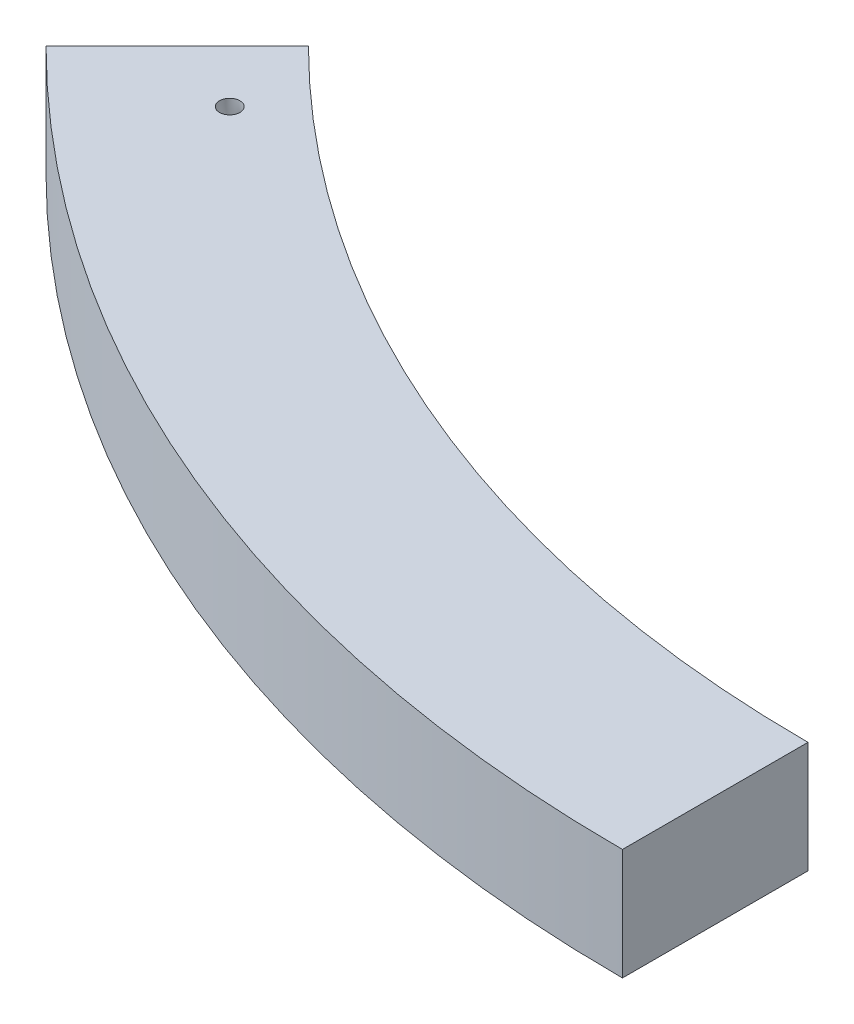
ISO-10303-21;
HEADER;
FILE_DESCRIPTION(('STEP AP214'),'2;1');
FILE_NAME('part.step','',(''),(''),'','','');
FILE_SCHEMA(('AUTOMOTIVE_DESIGN { 1 0 10303 214 1 1 1 1 }'));
ENDSEC;
DATA;
#1=APPLICATION_CONTEXT('core data for automotive mechanical design processes');
#2=APPLICATION_PROTOCOL_DEFINITION('international standard','automotive_design',2000,#1);
#3=PRODUCT_CONTEXT('',#1,'mechanical');
#4=PRODUCT('Part','Part','',(#3));
#5=PRODUCT_RELATED_PRODUCT_CATEGORY('part','',(#4));
#6=PRODUCT_DEFINITION_FORMATION('','',#4);
#7=PRODUCT_DEFINITION_CONTEXT('part definition',#1,'design');
#8=PRODUCT_DEFINITION('design','',#6,#7);
#9=PRODUCT_DEFINITION_SHAPE('','',#8);
#10=(LENGTH_UNIT() NAMED_UNIT(*) SI_UNIT(.MILLI.,.METRE.));
#11=(NAMED_UNIT(*) PLANE_ANGLE_UNIT() SI_UNIT($,.RADIAN.));
#12=(NAMED_UNIT(*) SI_UNIT($,.STERADIAN.) SOLID_ANGLE_UNIT());
#13=UNCERTAINTY_MEASURE_WITH_UNIT(LENGTH_MEASURE(1.E-05),#10,'distance_accuracy_value','');
#14=(GEOMETRIC_REPRESENTATION_CONTEXT(3) GLOBAL_UNCERTAINTY_ASSIGNED_CONTEXT((#13)) GLOBAL_UNIT_ASSIGNED_CONTEXT((#10,
#11,#12)) REPRESENTATION_CONTEXT('',''));
#15=CARTESIAN_POINT('',(0.,0.,0.));
#16=DIRECTION('',(0.,0.,1.));
#17=DIRECTION('',(1.,0.,0.));
#18=AXIS2_PLACEMENT_3D('',#15,#16,#17);
#19=CARTESIAN_POINT('',(0.,300.,0.));
#20=DIRECTION('',(0.,-1.,0.));
#21=DIRECTION('',(0.,0.,-1.));
#22=AXIS2_PLACEMENT_3D('',#19,#20,#21);
#23=CYLINDRICAL_SURFACE('',#22,3250.);
#24=CARTESIAN_POINT('',(-2170.99569715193,138.543366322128,2418.52799797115));
#25=CARTESIAN_POINT('',(-2171.23673635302,139.243817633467,2418.31162878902));
#26=CARTESIAN_POINT('',(-2171.45571442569,139.95785837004,2418.11499897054));
#27=CARTESIAN_POINT('',(-2171.84817019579,141.408426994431,2417.76251869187));
#28=CARTESIAN_POINT('',(-2172.02163584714,142.144960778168,2417.60667902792));
#29=CARTESIAN_POINT('',(-2172.32193749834,143.635870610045,2417.336848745));
#30=CARTESIAN_POINT('',(-2172.44872146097,144.390265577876,2417.22290482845));
#31=CARTESIAN_POINT('',(-2172.65451857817,145.910692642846,2417.03793147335));
#32=CARTESIAN_POINT('',(-2172.73353491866,146.676723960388,2416.96689917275));
#33=CARTESIAN_POINT('',(-2172.84324776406,148.214622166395,2416.86826824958));
#34=CARTESIAN_POINT('',(-2172.87396884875,148.986485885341,2416.84064753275));
#35=CARTESIAN_POINT('',(-2172.88697573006,150.530962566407,2416.82895356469));
#36=CARTESIAN_POINT('',(-2172.86926076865,151.303575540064,2416.84488099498));
#37=CARTESIAN_POINT('',(-2172.7855503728,152.843858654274,2416.9201383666));
#38=CARTESIAN_POINT('',(-2172.7195672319,153.611530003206,2416.97945725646));
#39=CARTESIAN_POINT('',(-2172.53981727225,155.136689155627,2417.1410295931));
#40=CARTESIAN_POINT('',(-2172.42605059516,155.894176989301,2417.24328291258));
#41=CARTESIAN_POINT('',(-2172.1513820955,157.394522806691,2417.49010491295));
#42=CARTESIAN_POINT('',(-2171.99042349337,158.137362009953,2417.63472456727));
#43=CARTESIAN_POINT('',(-2171.62256766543,159.602212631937,2417.96515373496));
#44=CARTESIAN_POINT('',(-2171.41567037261,160.324224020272,2418.15096330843));
#45=CARTESIAN_POINT('',(-2170.95738878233,161.742354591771,2418.5624058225));
#46=CARTESIAN_POINT('',(-2170.70600241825,162.438472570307,2418.78804061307));
#47=CARTESIAN_POINT('',(-2170.16051829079,163.799877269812,2419.27746632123));
#48=CARTESIAN_POINT('',(-2169.8664204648,164.465163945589,2419.54125729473));
#49=CARTESIAN_POINT('',(-2169.23685996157,165.76170285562,2420.10570522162));
#50=CARTESIAN_POINT('',(-2168.90130469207,166.392874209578,2420.40644468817));
#51=CARTESIAN_POINT('',(-2168.19171744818,167.615097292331,2421.0421109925));
#52=CARTESIAN_POINT('',(-2167.81768541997,168.206148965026,2421.37703787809));
#53=CARTESIAN_POINT('',(-2167.03376292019,169.343978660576,2422.0786417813));
#54=CARTESIAN_POINT('',(-2166.62387210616,169.890756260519,2422.44531910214));
#55=CARTESIAN_POINT('',(-2165.77110309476,170.936189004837,2423.20776163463));
#56=CARTESIAN_POINT('',(-2165.32822484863,171.434844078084,2423.60352688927));
#57=CARTESIAN_POINT('',(-2164.41146915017,172.381671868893,2424.42227566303));
#58=CARTESIAN_POINT('',(-2163.93751941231,172.829719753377,2424.8453226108));
#59=CARTESIAN_POINT('',(-2162.96290795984,173.670777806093,2425.71471635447));
#60=CARTESIAN_POINT('',(-2162.46224619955,174.063787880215,2426.1610631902));
#61=CARTESIAN_POINT('',(-2161.43771940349,174.79199476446,2427.07384637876));
#62=CARTESIAN_POINT('',(-2160.91385418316,175.127191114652,2427.54028289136));
#63=CARTESIAN_POINT('',(-2159.84660150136,175.737390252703,2428.48989458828));
#64=CARTESIAN_POINT('',(-2159.30321403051,176.012393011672,2428.97306978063));
#65=CARTESIAN_POINT('',(-2158.20000522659,176.5005680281,2429.95334988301));
#66=CARTESIAN_POINT('',(-2157.64016308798,176.713657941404,2430.45047238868));
#67=CARTESIAN_POINT('',(-2156.50868618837,177.075982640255,2431.45447385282));
#68=CARTESIAN_POINT('',(-2155.93705141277,177.225217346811,2431.96135282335));
#69=CARTESIAN_POINT('',(-2154.78603575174,177.458737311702,2432.9812435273));
#70=CARTESIAN_POINT('',(-2154.20665485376,177.543022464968,2433.49425527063));
#71=CARTESIAN_POINT('',(-2153.04426408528,177.645999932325,2434.52274565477));
#72=CARTESIAN_POINT('',(-2152.46125421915,177.664692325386,2435.0382242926));
#73=CARTESIAN_POINT('',(-2151.29629701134,177.636313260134,2436.06749620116));
#74=CARTESIAN_POINT('',(-2150.71434918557,177.589302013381,2436.58129058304));
#75=CARTESIAN_POINT('',(-2149.55514169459,177.429901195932,2437.60400603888));
#76=CARTESIAN_POINT('',(-2148.97788202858,177.317511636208,2438.11292711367));
#77=CARTESIAN_POINT('',(-2147.8322047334,177.028098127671,2439.12226080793));
#78=CARTESIAN_POINT('',(-2147.26378699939,176.851074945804,2439.6226735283));
#79=CARTESIAN_POINT('',(-2146.13989021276,176.433599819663,2440.61142582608));
#80=CARTESIAN_POINT('',(-2145.58441112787,176.193148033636,2441.09976543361));
#81=CARTESIAN_POINT('',(-2144.49211187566,175.651321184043,2442.05939916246));
#82=CARTESIAN_POINT('',(-2143.95523933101,175.350136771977,2442.5307413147));
#83=CARTESIAN_POINT('',(-2142.90224247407,174.688484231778,2443.45461792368));
#84=CARTESIAN_POINT('',(-2142.38611812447,174.328016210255,2443.90715241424));
#85=CARTESIAN_POINT('',(-2141.3783766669,173.550335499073,2444.79019485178));
#86=CARTESIAN_POINT('',(-2140.8867591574,173.133123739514,2445.22070315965));
#87=CARTESIAN_POINT('',(-2139.93160713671,172.244903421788,2446.05664685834));
#88=CARTESIAN_POINT('',(-2139.46807256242,171.773894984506,2446.4620823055));
#89=CARTESIAN_POINT('',(-2138.57406434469,170.783196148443,2447.24361735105));
#90=CARTESIAN_POINT('',(-2138.14347920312,170.263684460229,2447.61981595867));
#91=CARTESIAN_POINT('',(-2137.3166856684,169.178261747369,2448.34182386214));
#92=CARTESIAN_POINT('',(-2136.92047719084,168.61235083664,2448.6876332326));
#93=CARTESIAN_POINT('',(-2136.16532129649,167.438165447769,2449.34643757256));
#94=CARTESIAN_POINT('',(-2135.80637346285,166.829891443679,2449.65943290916));
#95=CARTESIAN_POINT('',(-2135.12834127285,165.575314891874,2450.25042977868));
#96=CARTESIAN_POINT('',(-2134.80925689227,164.92901236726,2450.52843133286));
#97=CARTESIAN_POINT('',(-2134.21381649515,163.604224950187,2451.04702956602));
#98=CARTESIAN_POINT('',(-2133.93738251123,162.925801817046,2451.28769450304));
#99=CARTESIAN_POINT('',(-2133.42852446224,161.540500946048,2451.73058162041));
#100=CARTESIAN_POINT('',(-2133.19610032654,160.833623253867,2451.93280386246));
#101=CARTESIAN_POINT('',(-2132.77692509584,159.396444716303,2452.29742588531));
#102=CARTESIAN_POINT('',(-2132.59017398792,158.666143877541,2452.45982567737));
#103=CARTESIAN_POINT('',(-2132.26367004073,157.187311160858,2452.74370619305));
#104=CARTESIAN_POINT('',(-2132.12391725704,156.438779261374,2452.86518686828));
#105=CARTESIAN_POINT('',(-2131.89229940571,154.928212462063,2453.06649875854));
#106=CARTESIAN_POINT('',(-2131.80047160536,154.166167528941,2453.14629756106));
#107=CARTESIAN_POINT('',(-2131.66549677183,152.634549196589,2453.2635850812));
#108=CARTESIAN_POINT('',(-2131.62234974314,151.864975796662,2453.30107379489));
#109=CARTESIAN_POINT('',(-2131.58500939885,150.323742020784,2453.33351754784));
#110=CARTESIAN_POINT('',(-2131.59081651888,149.552081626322,2453.32847220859));
#111=CARTESIAN_POINT('',(-2131.65130376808,148.012130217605,2453.27591614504));
#112=CARTESIAN_POINT('',(-2131.70598399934,147.243839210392,2453.22840533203));
#113=CARTESIAN_POINT('',(-2131.86399732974,145.71398220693,2453.09109244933));
#114=CARTESIAN_POINT('',(-2131.96746103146,144.952439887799,2453.00117685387));
#115=CARTESIAN_POINT('',(-2132.22230450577,143.443568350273,2452.77966247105));
#116=CARTESIAN_POINT('',(-2132.37368435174,142.696239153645,2452.64806361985));
#117=CARTESIAN_POINT('',(-2132.72323565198,141.22105513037,2452.3441140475));
#118=CARTESIAN_POINT('',(-2132.92140772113,140.493200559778,2452.17176279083));
#119=CARTESIAN_POINT('',(-2133.36308483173,139.062099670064,2451.78751809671));
#120=CARTESIAN_POINT('',(-2133.60658995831,138.358853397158,2451.57562458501));
#121=CARTESIAN_POINT('',(-2134.13796772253,136.979810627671,2451.1130653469));
#122=CARTESIAN_POINT('',(-2134.42597349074,136.304104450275,2450.86228327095));
#123=CARTESIAN_POINT('',(-2135.04370915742,134.987199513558,2450.32416788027));
#124=CARTESIAN_POINT('',(-2135.37343914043,134.34600082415,2450.0368344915));
#125=CARTESIAN_POINT('',(-2136.07223468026,133.102634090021,2449.42761130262));
#126=CARTESIAN_POINT('',(-2136.44130059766,132.500466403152,2449.10572118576));
#127=CARTESIAN_POINT('',(-2137.21609972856,131.339421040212,2448.42962066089));
#128=CARTESIAN_POINT('',(-2137.62183297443,130.780543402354,2448.07541022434));
#129=CARTESIAN_POINT('',(-2138.46788891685,129.708960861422,2447.33638964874));
#130=CARTESIAN_POINT('',(-2138.9082789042,129.196350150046,2446.95151996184));
#131=CARTESIAN_POINT('',(-2139.81976691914,128.222198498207,2446.15447826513));
#132=CARTESIAN_POINT('',(-2140.29086499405,127.760657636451,2445.74230621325));
#133=CARTESIAN_POINT('',(-2141.26038390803,126.891928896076,2444.89353210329));
#134=CARTESIAN_POINT('',(-2141.75880490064,126.484741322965,2444.45692990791));
#135=CARTESIAN_POINT('',(-2142.77938897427,125.727628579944,2443.562348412));
#136=CARTESIAN_POINT('',(-2143.30155204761,125.377703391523,2443.10436911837));
#137=CARTESIAN_POINT('',(-2144.36601067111,124.737541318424,2442.17012384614));
#138=CARTESIAN_POINT('',(-2144.90831123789,124.44731942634,2441.69385330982));
#139=CARTESIAN_POINT('',(-2146.00903560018,123.928764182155,2440.72648117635));
#140=CARTESIAN_POINT('',(-2146.56745940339,123.700430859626,2440.23537957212));
#141=CARTESIAN_POINT('',(-2147.6964306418,123.307308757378,2439.24180990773));
#142=CARTESIAN_POINT('',(-2148.26697806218,123.142519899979,2438.73934186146));
#143=CARTESIAN_POINT('',(-2149.41611330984,122.8776944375,2437.72659630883));
#144=CARTESIAN_POINT('',(-2149.9947011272,122.777657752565,2437.21631881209));
#145=CARTESIAN_POINT('',(-2151.1550241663,122.643173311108,2436.19224610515));
#146=CARTESIAN_POINT('',(-2151.73675433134,122.608640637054,2435.67845631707));
#147=CARTESIAN_POINT('',(-2152.89995553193,122.605190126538,2434.6503617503));
#148=CARTESIAN_POINT('',(-2153.48142656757,122.636272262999,2434.13605697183));
#149=CARTESIAN_POINT('',(-2154.6399347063,122.763864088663,2433.11063253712));
#150=CARTESIAN_POINT('',(-2155.21697201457,122.860370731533,2432.59951273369));
#151=CARTESIAN_POINT('',(-2156.36252429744,123.118155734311,2431.58410293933));
#152=CARTESIAN_POINT('',(-2156.93103929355,123.279433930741,2431.07981293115));
#153=CARTESIAN_POINT('',(-2158.0542333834,123.665210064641,2430.08281514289));
#154=CARTESIAN_POINT('',(-2158.60894063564,123.889565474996,2429.59008393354));
#155=CARTESIAN_POINT('',(-2159.70190326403,124.400077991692,2428.61858341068));
#156=CARTESIAN_POINT('',(-2160.24015859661,124.686235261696,2428.13981413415));
#157=CARTESIAN_POINT('',(-2161.2965285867,125.318416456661,2427.19958299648));
#158=CARTESIAN_POINT('',(-2161.81463823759,125.664455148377,2426.73812543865));
#159=CARTESIAN_POINT('',(-2162.8268936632,126.413896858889,2425.83599770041));
#160=CARTESIAN_POINT('',(-2163.32103984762,126.817298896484,2425.39532716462));
#161=CARTESIAN_POINT('',(-2164.28109656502,127.677909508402,2424.53866712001));
#162=CARTESIAN_POINT('',(-2164.74705159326,128.135029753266,2424.12263874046));
#163=CARTESIAN_POINT('',(-2165.64833513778,129.10038346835,2423.31748926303));
#164=CARTESIAN_POINT('',(-2166.08366165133,129.608620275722,2422.9283699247));
#165=CARTESIAN_POINT('',(-2166.92012380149,130.671985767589,2422.18031773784));
#166=CARTESIAN_POINT('',(-2167.32129709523,131.227061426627,2421.8213516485));
#167=CARTESIAN_POINT('',(-2168.08705355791,132.380441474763,2421.13584753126));
#168=CARTESIAN_POINT('',(-2168.45164639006,132.978734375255,2420.80930093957));
#169=CARTESIAN_POINT('',(-2169.22657946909,134.366245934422,2420.11495193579));
#170=CARTESIAN_POINT('',(-2169.62619331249,135.166290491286,2419.75668733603));
#171=CARTESIAN_POINT('',(-2170.36052900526,136.818307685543,2419.09805837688));
#172=CARTESIAN_POINT('',(-2170.69525091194,137.670280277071,2418.79769396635));
#173=CARTESIAN_POINT('',(-2170.99569715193,138.543366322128,2418.52799797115));
#174=B_SPLINE_CURVE_WITH_KNOTS('',3,(#24,#25,#26,#27,#28,#29,#30,#31,#32,#33,#34,#35,#36,#37,
#38,#39,#40,#41,#42,#43,#44,#45,#46,#47,#48,#49,#50,#51,#52,#53,#54,#55,#56,#57,#58,#59,#60,#61,
#62,#63,#64,#65,#66,#67,#68,#69,#70,#71,#72,#73,#74,#75,#76,#77,#78,#79,#80,#81,#82,#83,#84,#85,
#86,#87,#88,#89,#90,#91,#92,#93,#94,#95,#96,#97,#98,#99,#100,#101,#102,#103,#104,#105,#106,#107,
#108,#109,#110,#111,#112,#113,#114,#115,#116,#117,#118,#119,#120,#121,#122,#123,#124,#125,#126,
#127,#128,#129,#130,#131,#132,#133,#134,#135,#136,#137,#138,#139,#140,#141,#142,#143,#144,#145,
#146,#147,#148,#149,#150,#151,#152,#153,#154,#155,#156,#157,#158,#159,#160,#161,#162,#163,#164,
#165,#166,#167,#168,#169,#170,#171,#172,#173),.UNSPECIFIED.,.T.,.F.,(4,2,2,2,2,2,2,2,2,2,2,2,2,
2,2,2,2,2,2,2,2,2,2,2,2,2,2,2,2,2,2,2,2,2,2,2,2,2,2,2,2,2,2,2,2,2,2,2,2,2,2,2,2,2,2,2,2,2,2,2,2,
2,2,2,2,2,2,2,2,2,2,2,2,2,4),(0.,2.31431016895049,4.62923226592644,6.94672710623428,
9.26406736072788,11.5802278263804,13.8964245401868,16.2120315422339,18.5276316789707,
20.8460293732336,23.1644304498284,25.4829392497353,27.801451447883,30.1252388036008,
32.4490294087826,34.772842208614,37.0966584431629,39.4260871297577,41.7555197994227,
44.0849709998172,46.4144233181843,48.7469597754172,51.0794991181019,53.4120422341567,
55.7445825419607,58.0749866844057,60.4053904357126,62.7357665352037,65.0661368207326,
67.3893024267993,69.7124638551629,72.0355872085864,74.3587053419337,76.6735784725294,
78.9884459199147,81.3032874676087,83.618127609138,85.9286846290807,88.2392379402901,
90.5497905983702,92.8603459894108,95.1726954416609,97.4850451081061,99.7974153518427,
102.109790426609,104.428391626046,106.746996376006,109.065631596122,111.384271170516,
113.70998664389,116.035706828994,118.361448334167,120.687191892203,123.017568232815,
125.347948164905,127.67834119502,130.008733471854,132.339710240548,134.670688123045,
137.001663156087,139.332635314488,141.660583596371,143.988530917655,146.316369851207,
148.64420290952,150.966817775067,153.289438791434,155.612633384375,157.935788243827,
160.255175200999,162.574713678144,164.891660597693,167.2079938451,170.092696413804,
172.977396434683),.UNSPECIFIED.);
#175=CARTESIAN_POINT('',(-2170.99569715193,138.543366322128,2418.52799797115));
#176=VERTEX_POINT('',#175);
#177=EDGE_CURVE('E103',#176,#176,#174,.T.);
#178=ORIENTED_EDGE('',*,*,#177,.F.);
#179=EDGE_LOOP('',(#178));
#180=FACE_BOUND('',#179,.T.);
#181=CARTESIAN_POINT('',(0.,0.,0.));
#182=DIRECTION('',(0.,1.,0.));
#183=DIRECTION('',(0.,0.,1.));
#184=AXIS2_PLACEMENT_3D('',#181,#182,#183);
#185=CIRCLE('',#184,3250.);
#186=CARTESIAN_POINT('',(-2298.09703885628,0.,2298.09703885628));
#187=VERTEX_POINT('',#186);
#188=CARTESIAN_POINT('',(3.9801020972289E-13,0.,3250.));
#189=VERTEX_POINT('',#188);
#190=EDGE_CURVE('E101',#187,#189,#185,.T.);
#191=ORIENTED_EDGE('',*,*,#190,.F.);
#192=DIRECTION('',(0.,-1.,0.));
#193=VECTOR('',#192,1.);
#194=CARTESIAN_POINT('',(-2298.09703885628,300.,2298.09703885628));
#195=LINE('',#194,#193);
#196=CARTESIAN_POINT('',(-2298.09703885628,300.,2298.09703885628));
#197=VERTEX_POINT('',#196);
#198=EDGE_CURVE('E11',#197,#187,#195,.T.);
#199=ORIENTED_EDGE('',*,*,#198,.F.);
#200=CARTESIAN_POINT('',(0.,300.,0.));
#201=DIRECTION('',(0.,1.,0.));
#202=DIRECTION('',(0.,0.,1.));
#203=AXIS2_PLACEMENT_3D('',#200,#201,#202);
#204=CIRCLE('',#203,3250.);
#205=CARTESIAN_POINT('',(3.9801020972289E-13,300.,3250.));
#206=VERTEX_POINT('',#205);
#207=EDGE_CURVE('E85',#197,#206,#204,.T.);
#208=ORIENTED_EDGE('',*,*,#207,.T.);
#209=DIRECTION('',(0.,-1.,0.));
#210=VECTOR('',#209,1.);
#211=CARTESIAN_POINT('',(3.9801020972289E-13,300.,3250.));
#212=LINE('',#211,#210);
#213=EDGE_CURVE('E53',#206,#189,#212,.T.);
#214=ORIENTED_EDGE('',*,*,#213,.T.);
#215=EDGE_LOOP('',(#191,#199,#208,#214));
#216=FACE_BOUND('',#215,.T.);
#217=ADVANCED_FACE('F35',(#180,#216),#23,.F.);
#218=CARTESIAN_POINT('',(0.,300.,0.));
#219=DIRECTION('',(0.707106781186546,0.,0.707106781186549));
#220=DIRECTION('',(0.707106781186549,0.,-0.707106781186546));
#221=AXIS2_PLACEMENT_3D('',#218,#219,#220);
#222=PLANE('',#221);
#223=DIRECTION('',(-0.707106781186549,0.,0.707106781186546));
#224=VECTOR('',#223,1.);
#225=CARTESIAN_POINT('',(0.,0.,0.));
#226=LINE('',#225,#224);
#227=CARTESIAN_POINT('',(-2651.65042944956,0.,2651.65042944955));
#228=VERTEX_POINT('',#227);
#229=EDGE_CURVE('E91',#187,#228,#226,.T.);
#230=ORIENTED_EDGE('',*,*,#229,.T.);
#231=DIRECTION('',(0.,-1.,0.));
#232=VECTOR('',#231,1.);
#233=CARTESIAN_POINT('',(-2651.65042944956,300.,2651.65042944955));
#234=LINE('',#233,#232);
#235=CARTESIAN_POINT('',(-2651.65042944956,300.,2651.65042944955));
#236=VERTEX_POINT('',#235);
#237=EDGE_CURVE('E45',#236,#228,#234,.T.);
#238=ORIENTED_EDGE('',*,*,#237,.F.);
#239=DIRECTION('',(-0.707106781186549,0.,0.707106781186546));
#240=VECTOR('',#239,1.);
#241=CARTESIAN_POINT('',(0.,300.,0.));
#242=LINE('',#241,#240);
#243=EDGE_CURVE('E79',#197,#236,#242,.T.);
#244=ORIENTED_EDGE('',*,*,#243,.F.);
#245=ORIENTED_EDGE('',*,*,#198,.T.);
#246=EDGE_LOOP('',(#230,#238,#244,#245));
#247=FACE_BOUND('',#246,.T.);
#248=ADVANCED_FACE('F89',(#247),#222,.F.);
#249=CARTESIAN_POINT('',(0.,300.,0.));
#250=DIRECTION('',(0.,-1.,0.));
#251=DIRECTION('',(0.,0.,-1.));
#252=AXIS2_PLACEMENT_3D('',#249,#250,#251);
#253=CYLINDRICAL_SURFACE('',#252,3750.);
#254=CARTESIAN_POINT('',(0.,0.,0.));
#255=DIRECTION('',(0.,1.,0.));
#256=DIRECTION('',(0.,0.,1.));
#257=AXIS2_PLACEMENT_3D('',#254,#255,#256);
#258=CIRCLE('',#257,3750.);
#259=CARTESIAN_POINT('',(4.59242549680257E-13,0.,3750.));
#260=VERTEX_POINT('',#259);
#261=EDGE_CURVE('E105',#228,#260,#258,.T.);
#262=ORIENTED_EDGE('',*,*,#261,.T.);
#263=DIRECTION('',(0.,-1.,0.));
#264=VECTOR('',#263,1.);
#265=CARTESIAN_POINT('',(4.59242549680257E-13,300.,3750.));
#266=LINE('',#265,#264);
#267=CARTESIAN_POINT('',(4.59242549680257E-13,300.,3750.));
#268=VERTEX_POINT('',#267);
#269=EDGE_CURVE('E67',#268,#260,#266,.T.);
#270=ORIENTED_EDGE('',*,*,#269,.F.);
#271=CARTESIAN_POINT('',(0.,300.,0.));
#272=DIRECTION('',(0.,1.,0.));
#273=DIRECTION('',(0.,0.,1.));
#274=AXIS2_PLACEMENT_3D('',#271,#272,#273);
#275=CIRCLE('',#274,3750.);
#276=EDGE_CURVE('E84',#236,#268,#275,.T.);
#277=ORIENTED_EDGE('',*,*,#276,.F.);
#278=ORIENTED_EDGE('',*,*,#237,.T.);
#279=EDGE_LOOP('',(#262,#270,#277,#278));
#280=FACE_BOUND('',#279,.T.);
#281=ADVANCED_FACE('F95',(#280),#253,.T.);
#282=CARTESIAN_POINT('',(0.,300.,0.));
#283=DIRECTION('',(1.,0.,0.));
#284=DIRECTION('',(0.,0.,-1.));
#285=AXIS2_PLACEMENT_3D('',#282,#283,#284);
#286=PLANE('',#285);
#287=DIRECTION('',(0.,0.,1.));
#288=VECTOR('',#287,1.);
#289=CARTESIAN_POINT('',(0.,0.,0.));
#290=LINE('',#289,#288);
#291=EDGE_CURVE('E107',#189,#260,#290,.T.);
#292=ORIENTED_EDGE('',*,*,#291,.F.);
#293=ORIENTED_EDGE('',*,*,#213,.F.);
#294=DIRECTION('',(0.,0.,1.));
#295=VECTOR('',#294,1.);
#296=CARTESIAN_POINT('',(0.,300.,0.));
#297=LINE('',#296,#295);
#298=EDGE_CURVE('E96',#206,#268,#297,.T.);
#299=ORIENTED_EDGE('',*,*,#298,.T.);
#300=ORIENTED_EDGE('',*,*,#269,.T.);
#301=EDGE_LOOP('',(#292,#293,#299,#300));
#302=FACE_BOUND('',#301,.T.);
#303=ADVANCED_FACE('F126',(#302),#286,.T.);
#304=CARTESIAN_POINT('',(0.,300.,0.));
#305=DIRECTION('',(0.,1.,0.));
#306=DIRECTION('',(0.,0.,1.));
#307=AXIS2_PLACEMENT_3D('',#304,#305,#306);
#308=PLANE('',#307);
#309=CARTESIAN_POINT('',(-2262.74169979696,300.,2545.58441227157));
#310=DIRECTION('',(0.,1.,0.));
#311=DIRECTION('',(0.,0.,1.));
#312=AXIS2_PLACEMENT_3D('',#309,#310,#311);
#313=CIRCLE('',#312,27.4999999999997);
#314=CARTESIAN_POINT('',(-2262.74169979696,300.,2573.08441227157));
#315=VERTEX_POINT('',#314);
#316=EDGE_CURVE('E39',#315,#315,#313,.T.);
#317=ORIENTED_EDGE('',*,*,#316,.F.);
#318=EDGE_LOOP('',(#317));
#319=FACE_BOUND('',#318,.T.);
#320=ORIENTED_EDGE('',*,*,#207,.F.);
#321=ORIENTED_EDGE('',*,*,#243,.T.);
#322=ORIENTED_EDGE('',*,*,#276,.T.);
#323=ORIENTED_EDGE('',*,*,#298,.F.);
#324=EDGE_LOOP('',(#320,#321,#322,#323));
#325=FACE_BOUND('',#324,.T.);
#326=ADVANCED_FACE('F81',(#319,#325),#308,.T.);
#327=CARTESIAN_POINT('',(0.,0.,0.));
#328=DIRECTION('',(0.,1.,0.));
#329=DIRECTION('',(0.,0.,1.));
#330=AXIS2_PLACEMENT_3D('',#327,#328,#329);
#331=PLANE('',#330);
#332=ORIENTED_EDGE('',*,*,#190,.T.);
#333=ORIENTED_EDGE('',*,*,#291,.T.);
#334=ORIENTED_EDGE('',*,*,#261,.F.);
#335=ORIENTED_EDGE('',*,*,#229,.F.);
#336=EDGE_LOOP('',(#332,#333,#334,#335));
#337=FACE_BOUND('',#336,.T.);
#338=ADVANCED_FACE('F122',(#337),#331,.F.);
#339=CARTESIAN_POINT('',(-2156.67568261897,300.,2439.51839509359));
#340=DIRECTION('',(-0.707106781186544,0.,-0.707106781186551));
#341=DIRECTION('',(-0.707106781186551,0.,0.707106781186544));
#342=AXIS2_PLACEMENT_3D('',#339,#340,#341);
#343=TOROIDAL_SURFACE('',#342,150.,27.4999999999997);
#344=ORIENTED_EDGE('',*,*,#177,.T.);
#345=EDGE_LOOP('',(#344));
#346=FACE_BOUND('',#345,.T.);
#347=ORIENTED_EDGE('',*,*,#316,.T.);
#348=EDGE_LOOP('',(#347));
#349=FACE_BOUND('',#348,.T.);
#350=ADVANCED_FACE('F118',(#346,#349),#343,.F.);
#351=CLOSED_SHELL('',(#217,#248,#281,#303,#326,#338,#350));
#352=MANIFOLD_SOLID_BREP('B2',#351);
#353=ADVANCED_BREP_SHAPE_REPRESENTATION('',(#18,#352),#14);
#354=SHAPE_DEFINITION_REPRESENTATION(#9,#353);
ENDSEC;
END-ISO-10303-21;
